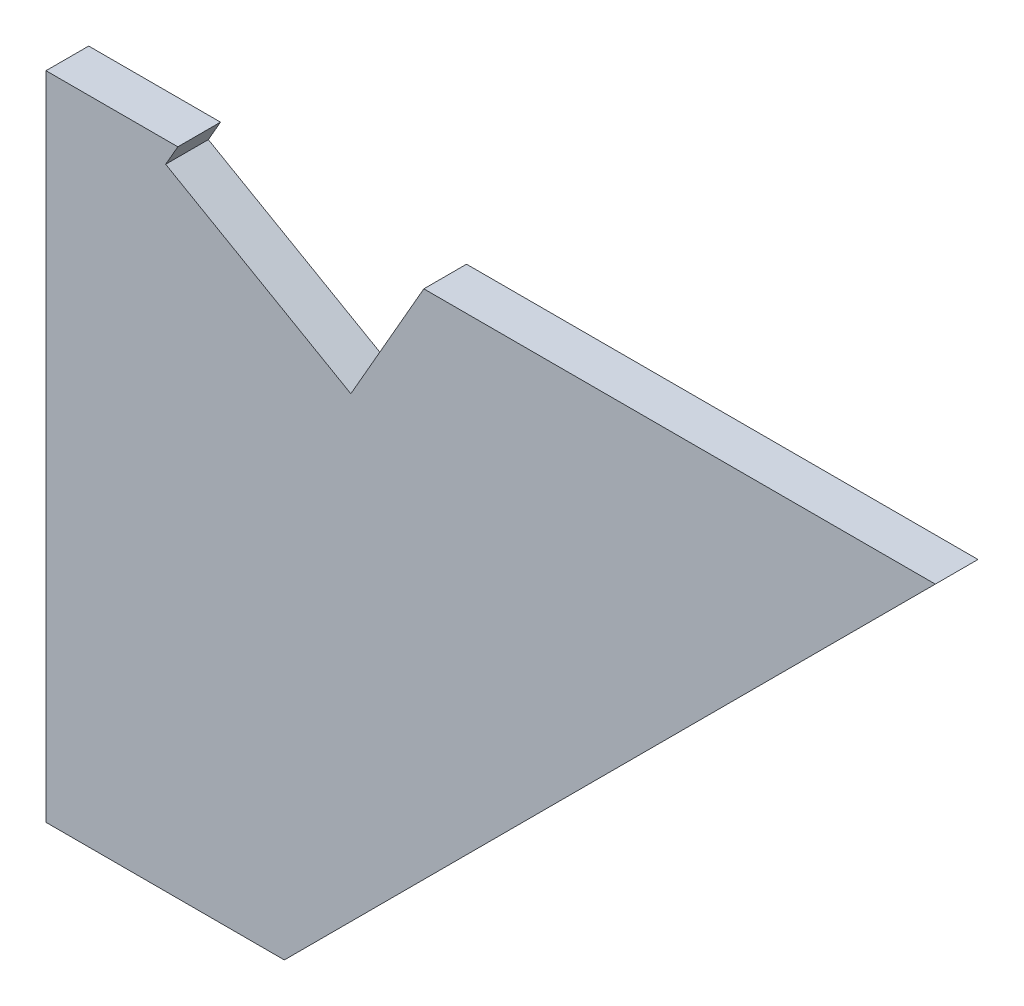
ISO-10303-21;
HEADER;
FILE_DESCRIPTION(('STEP AP214'),'2;1');
FILE_NAME('part.step','',(''),(''),'','','');
FILE_SCHEMA(('AUTOMOTIVE_DESIGN { 1 0 10303 214 1 1 1 1 }'));
ENDSEC;
DATA;
#1=APPLICATION_CONTEXT('core data for automotive mechanical design processes');
#2=APPLICATION_PROTOCOL_DEFINITION('international standard','automotive_design',2000,#1);
#3=PRODUCT_CONTEXT('',#1,'mechanical');
#4=PRODUCT('Part','Part','',(#3));
#5=PRODUCT_RELATED_PRODUCT_CATEGORY('part','',(#4));
#6=PRODUCT_DEFINITION_FORMATION('','',#4);
#7=PRODUCT_DEFINITION_CONTEXT('part definition',#1,'design');
#8=PRODUCT_DEFINITION('design','',#6,#7);
#9=PRODUCT_DEFINITION_SHAPE('','',#8);
#10=(LENGTH_UNIT() NAMED_UNIT(*) SI_UNIT(.MILLI.,.METRE.));
#11=(NAMED_UNIT(*) PLANE_ANGLE_UNIT() SI_UNIT($,.RADIAN.));
#12=(NAMED_UNIT(*) SI_UNIT($,.STERADIAN.) SOLID_ANGLE_UNIT());
#13=UNCERTAINTY_MEASURE_WITH_UNIT(LENGTH_MEASURE(1.E-05),#10,'distance_accuracy_value','');
#14=(GEOMETRIC_REPRESENTATION_CONTEXT(3) GLOBAL_UNCERTAINTY_ASSIGNED_CONTEXT((#13)) GLOBAL_UNIT_ASSIGNED_CONTEXT((#10,
#11,#12)) REPRESENTATION_CONTEXT('',''));
#15=CARTESIAN_POINT('',(0.,0.,0.));
#16=DIRECTION('',(0.,0.,1.));
#17=DIRECTION('',(1.,0.,0.));
#18=AXIS2_PLACEMENT_3D('',#15,#16,#17);
#19=CARTESIAN_POINT('',(250.,125.,0.));
#20=DIRECTION('',(0.707106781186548,-0.707106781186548,0.));
#21=DIRECTION('',(0.,0.,-1.));
#22=AXIS2_PLACEMENT_3D('',#19,#20,#21);
#23=PLANE('',#22);
#24=DIRECTION('',(-0.707106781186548,-0.707106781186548,0.));
#25=VECTOR('',#24,1.);
#26=CARTESIAN_POINT('',(250.,125.,0.));
#27=LINE('',#26,#25);
#28=CARTESIAN_POINT('',(250.,125.,0.));
#29=VERTEX_POINT('',#28);
#30=CARTESIAN_POINT('',(66.999999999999,-58.,0.));
#31=VERTEX_POINT('',#30);
#32=EDGE_CURVE('E139',#29,#31,#27,.T.);
#33=ORIENTED_EDGE('',*,*,#32,.F.);
#34=DIRECTION('',(0.,0.,1.));
#35=VECTOR('',#34,1.);
#36=CARTESIAN_POINT('',(250.,125.,0.));
#37=LINE('',#36,#35);
#38=CARTESIAN_POINT('',(250.,125.,12.));
#39=VERTEX_POINT('',#38);
#40=EDGE_CURVE('E36',#29,#39,#37,.T.);
#41=ORIENTED_EDGE('',*,*,#40,.T.);
#42=DIRECTION('',(-0.707106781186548,-0.707106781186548,0.));
#43=VECTOR('',#42,1.);
#44=CARTESIAN_POINT('',(250.,125.,12.));
#45=LINE('',#44,#43);
#46=CARTESIAN_POINT('',(66.999999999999,-58.,12.));
#47=VERTEX_POINT('',#46);
#48=EDGE_CURVE('E163',#39,#47,#45,.T.);
#49=ORIENTED_EDGE('',*,*,#48,.T.);
#50=DIRECTION('',(0.,0.,1.));
#51=VECTOR('',#50,1.);
#52=CARTESIAN_POINT('',(66.999999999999,-58.,0.));
#53=LINE('',#52,#51);
#54=EDGE_CURVE('E49',#31,#47,#53,.T.);
#55=ORIENTED_EDGE('',*,*,#54,.F.);
#56=EDGE_LOOP('',(#33,#41,#49,#55));
#57=FACE_BOUND('',#56,.T.);
#58=ADVANCED_FACE('F16',(#57),#23,.T.);
#59=CARTESIAN_POINT('',(33.638951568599,119.03142836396,-24.001));
#60=DIRECTION('',(0.867615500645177,-0.497235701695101,0.));
#61=DIRECTION('',(0.,0.,-1.));
#62=AXIS2_PLACEMENT_3D('',#59,#60,#61);
#63=PLANE('',#62);
#64=DIRECTION('',(0.,0.,1.));
#65=VECTOR('',#64,1.);
#66=CARTESIAN_POINT('',(33.638951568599,119.03142836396,-24.001));
#67=LINE('',#66,#65);
#68=CARTESIAN_POINT('',(33.638951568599,119.03142836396,0.));
#69=VERTEX_POINT('',#68);
#70=CARTESIAN_POINT('',(33.638951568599,119.03142836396,12.));
#71=VERTEX_POINT('',#70);
#72=EDGE_CURVE('E10',#69,#71,#67,.T.);
#73=ORIENTED_EDGE('',*,*,#72,.F.);
#74=DIRECTION('',(-0.497235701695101,-0.867615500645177,0.));
#75=VECTOR('',#74,1.);
#76=CARTESIAN_POINT('',(22.62883027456,99.820112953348,0.));
#77=LINE('',#76,#75);
#78=CARTESIAN_POINT('',(37.059576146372,125.,0.));
#79=VERTEX_POINT('',#78);
#80=EDGE_CURVE('E120',#79,#69,#77,.T.);
#81=ORIENTED_EDGE('',*,*,#80,.F.);
#82=DIRECTION('',(0.,0.,-1.));
#83=VECTOR('',#82,1.);
#84=CARTESIAN_POINT('',(37.059576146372,125.,-12.0005));
#85=LINE('',#84,#83);
#86=CARTESIAN_POINT('',(37.059576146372,125.,12.));
#87=VERTEX_POINT('',#86);
#88=EDGE_CURVE('E105',#87,#79,#85,.T.);
#89=ORIENTED_EDGE('',*,*,#88,.F.);
#90=DIRECTION('',(-0.497235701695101,-0.867615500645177,0.));
#91=VECTOR('',#90,1.);
#92=CARTESIAN_POINT('',(22.62883027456,99.820112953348,12.));
#93=LINE('',#92,#91);
#94=EDGE_CURVE('E149',#87,#71,#93,.T.);
#95=ORIENTED_EDGE('',*,*,#94,.T.);
#96=EDGE_LOOP('',(#73,#81,#89,#95));
#97=FACE_BOUND('',#96,.T.);
#98=ADVANCED_FACE('F121',(#97),#63,.T.);
#99=CARTESIAN_POINT('',(33.638951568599,119.03142836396,-24.001));
#100=DIRECTION('',(0.497235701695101,0.867615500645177,0.));
#101=DIRECTION('',(0.,0.,-1.));
#102=AXIS2_PLACEMENT_3D('',#99,#100,#101);
#103=PLANE('',#102);
#104=DIRECTION('',(0.,0.,1.));
#105=VECTOR('',#104,1.);
#106=CARTESIAN_POINT('',(85.6976168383,89.196291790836,-24.001));
#107=LINE('',#106,#105);
#108=CARTESIAN_POINT('',(85.6976168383,89.196291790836,0.));
#109=VERTEX_POINT('',#108);
#110=CARTESIAN_POINT('',(85.6976168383,89.196291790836,12.));
#111=VERTEX_POINT('',#110);
#112=EDGE_CURVE('E24',#109,#111,#107,.T.);
#113=ORIENTED_EDGE('',*,*,#112,.F.);
#114=DIRECTION('',(0.867615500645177,-0.497235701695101,0.));
#115=VECTOR('',#114,1.);
#116=CARTESIAN_POINT('',(72.023770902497,97.032855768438,0.));
#117=LINE('',#116,#115);
#118=EDGE_CURVE('E126',#69,#109,#117,.T.);
#119=ORIENTED_EDGE('',*,*,#118,.F.);
#120=ORIENTED_EDGE('',*,*,#72,.T.);
#121=DIRECTION('',(0.867615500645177,-0.497235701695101,0.));
#122=VECTOR('',#121,1.);
#123=CARTESIAN_POINT('',(72.023770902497,97.032855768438,12.));
#124=LINE('',#123,#122);
#125=EDGE_CURVE('E146',#71,#111,#124,.T.);
#126=ORIENTED_EDGE('',*,*,#125,.T.);
#127=EDGE_LOOP('',(#113,#119,#120,#126));
#128=FACE_BOUND('',#127,.T.);
#129=ADVANCED_FACE('F213',(#128),#103,.T.);
#130=CARTESIAN_POINT('',(85.6976168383,89.196291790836,-24.001));
#131=DIRECTION('',(0.867615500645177,-0.497235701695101,0.));
#132=DIRECTION('',(0.,0.,-1.));
#133=AXIS2_PLACEMENT_3D('',#130,#131,#132);
#134=PLANE('',#133);
#135=DIRECTION('',(-0.497235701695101,-0.867615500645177,0.));
#136=VECTOR('',#135,1.);
#137=CARTESIAN_POINT('',(74.687495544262,69.98497638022,12.));
#138=LINE('',#137,#136);
#139=CARTESIAN_POINT('',(106.21693900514,125.,12.));
#140=VERTEX_POINT('',#139);
#141=EDGE_CURVE('E117',#140,#111,#138,.T.);
#142=ORIENTED_EDGE('',*,*,#141,.F.);
#143=DIRECTION('',(0.,0.,-1.));
#144=VECTOR('',#143,1.);
#145=CARTESIAN_POINT('',(106.21693900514,125.,-12.0005));
#146=LINE('',#145,#144);
#147=CARTESIAN_POINT('',(106.21693900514,125.,0.));
#148=VERTEX_POINT('',#147);
#149=EDGE_CURVE('E65',#140,#148,#146,.T.);
#150=ORIENTED_EDGE('',*,*,#149,.T.);
#151=DIRECTION('',(-0.497235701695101,-0.867615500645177,0.));
#152=VECTOR('',#151,1.);
#153=CARTESIAN_POINT('',(74.687495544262,69.98497638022,0.));
#154=LINE('',#153,#152);
#155=EDGE_CURVE('E145',#148,#109,#154,.T.);
#156=ORIENTED_EDGE('',*,*,#155,.T.);
#157=ORIENTED_EDGE('',*,*,#112,.T.);
#158=EDGE_LOOP('',(#142,#150,#156,#157));
#159=FACE_BOUND('',#158,.T.);
#160=ADVANCED_FACE('F185',(#159),#134,.F.);
#161=CARTESIAN_POINT('',(0.,125.,0.));
#162=DIRECTION('',(0.,1.,0.));
#163=DIRECTION('',(1.,0.,0.));
#164=AXIS2_PLACEMENT_3D('',#161,#162,#163);
#165=PLANE('',#164);
#166=DIRECTION('',(1.,0.,0.));
#167=VECTOR('',#166,1.);
#168=CARTESIAN_POINT('',(0.,125.,0.));
#169=LINE('',#168,#167);
#170=EDGE_CURVE('E283',#148,#29,#169,.T.);
#171=ORIENTED_EDGE('',*,*,#170,.F.);
#172=ORIENTED_EDGE('',*,*,#149,.F.);
#173=DIRECTION('',(1.,0.,0.));
#174=VECTOR('',#173,1.);
#175=CARTESIAN_POINT('',(0.,125.,12.));
#176=LINE('',#175,#174);
#177=EDGE_CURVE('E166',#140,#39,#176,.T.);
#178=ORIENTED_EDGE('',*,*,#177,.T.);
#179=ORIENTED_EDGE('',*,*,#40,.F.);
#180=EDGE_LOOP('',(#171,#172,#178,#179));
#181=FACE_BOUND('',#180,.T.);
#182=ADVANCED_FACE('F179',(#181),#165,.T.);
#183=CARTESIAN_POINT('',(0.,-58.,0.));
#184=DIRECTION('',(0.,1.,0.));
#185=DIRECTION('',(1.,0.,0.));
#186=AXIS2_PLACEMENT_3D('',#183,#184,#185);
#187=PLANE('',#186);
#188=DIRECTION('',(1.,0.,0.));
#189=VECTOR('',#188,1.);
#190=CARTESIAN_POINT('',(44.194173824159,-58.,0.));
#191=LINE('',#190,#189);
#192=CARTESIAN_POINT('',(0.,-58.,0.));
#193=VERTEX_POINT('',#192);
#194=EDGE_CURVE('E135',#193,#31,#191,.T.);
#195=ORIENTED_EDGE('',*,*,#194,.T.);
#196=ORIENTED_EDGE('',*,*,#54,.T.);
#197=DIRECTION('',(1.,0.,0.));
#198=VECTOR('',#197,1.);
#199=CARTESIAN_POINT('',(44.194173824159,-58.,12.));
#200=LINE('',#199,#198);
#201=CARTESIAN_POINT('',(0.,-58.,12.));
#202=VERTEX_POINT('',#201);
#203=EDGE_CURVE('E159',#202,#47,#200,.T.);
#204=ORIENTED_EDGE('',*,*,#203,.F.);
#205=DIRECTION('',(0.,0.,-1.));
#206=VECTOR('',#205,1.);
#207=CARTESIAN_POINT('',(0.,-58.,0.));
#208=LINE('',#207,#206);
#209=EDGE_CURVE('E266',#202,#193,#208,.T.);
#210=ORIENTED_EDGE('',*,*,#209,.T.);
#211=EDGE_LOOP('',(#195,#196,#204,#210));
#212=FACE_BOUND('',#211,.T.);
#213=ADVANCED_FACE('F184',(#212),#187,.F.);
#214=CARTESIAN_POINT('',(88.388347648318,36.611652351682,12.));
#215=DIRECTION('',(0.,0.,-1.));
#216=DIRECTION('',(0.,-1.,0.));
#217=AXIS2_PLACEMENT_3D('',#214,#215,#216);
#218=PLANE('',#217);
#219=ORIENTED_EDGE('',*,*,#141,.T.);
#220=ORIENTED_EDGE('',*,*,#125,.F.);
#221=ORIENTED_EDGE('',*,*,#94,.F.);
#222=DIRECTION('',(1.,0.,0.));
#223=VECTOR('',#222,1.);
#224=CARTESIAN_POINT('',(0.,125.,12.));
#225=LINE('',#224,#223);
#226=CARTESIAN_POINT('',(0.,125.,12.));
#227=VERTEX_POINT('',#226);
#228=EDGE_CURVE('E113',#227,#87,#225,.T.);
#229=ORIENTED_EDGE('',*,*,#228,.F.);
#230=DIRECTION('',(0.,1.,0.));
#231=VECTOR('',#230,1.);
#232=CARTESIAN_POINT('',(0.,-125.,12.));
#233=LINE('',#232,#231);
#234=EDGE_CURVE('E269',#202,#227,#233,.T.);
#235=ORIENTED_EDGE('',*,*,#234,.F.);
#236=ORIENTED_EDGE('',*,*,#203,.T.);
#237=ORIENTED_EDGE('',*,*,#48,.F.);
#238=ORIENTED_EDGE('',*,*,#177,.F.);
#239=EDGE_LOOP('',(#219,#220,#221,#229,#235,#236,#237,#238));
#240=FACE_BOUND('',#239,.T.);
#241=ADVANCED_FACE('F222',(#240),#218,.F.);
#242=CARTESIAN_POINT('',(0.,125.,0.));
#243=DIRECTION('',(0.,1.,0.));
#244=DIRECTION('',(1.,0.,0.));
#245=AXIS2_PLACEMENT_3D('',#242,#243,#244);
#246=PLANE('',#245);
#247=DIRECTION('',(1.,0.,0.));
#248=VECTOR('',#247,1.);
#249=CARTESIAN_POINT('',(0.,125.,0.));
#250=LINE('',#249,#248);
#251=CARTESIAN_POINT('',(0.,125.,0.));
#252=VERTEX_POINT('',#251);
#253=EDGE_CURVE('E111',#252,#79,#250,.T.);
#254=ORIENTED_EDGE('',*,*,#253,.F.);
#255=DIRECTION('',(0.,0.,1.));
#256=VECTOR('',#255,1.);
#257=CARTESIAN_POINT('',(0.,125.,0.));
#258=LINE('',#257,#256);
#259=EDGE_CURVE('E271',#252,#227,#258,.T.);
#260=ORIENTED_EDGE('',*,*,#259,.T.);
#261=ORIENTED_EDGE('',*,*,#228,.T.);
#262=ORIENTED_EDGE('',*,*,#88,.T.);
#263=EDGE_LOOP('',(#254,#260,#261,#262));
#264=FACE_BOUND('',#263,.T.);
#265=ADVANCED_FACE('F107',(#264),#246,.T.);
#266=CARTESIAN_POINT('',(88.388347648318,36.611652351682,0.));
#267=DIRECTION('',(0.,0.,-1.));
#268=DIRECTION('',(0.,-1.,0.));
#269=AXIS2_PLACEMENT_3D('',#266,#267,#268);
#270=PLANE('',#269);
#271=ORIENTED_EDGE('',*,*,#170,.T.);
#272=ORIENTED_EDGE('',*,*,#32,.T.);
#273=ORIENTED_EDGE('',*,*,#194,.F.);
#274=DIRECTION('',(0.,1.,0.));
#275=VECTOR('',#274,1.);
#276=CARTESIAN_POINT('',(0.,-125.,0.));
#277=LINE('',#276,#275);
#278=EDGE_CURVE('E133',#193,#252,#277,.T.);
#279=ORIENTED_EDGE('',*,*,#278,.T.);
#280=ORIENTED_EDGE('',*,*,#253,.T.);
#281=ORIENTED_EDGE('',*,*,#80,.T.);
#282=ORIENTED_EDGE('',*,*,#118,.T.);
#283=ORIENTED_EDGE('',*,*,#155,.F.);
#284=EDGE_LOOP('',(#271,#272,#273,#279,#280,#281,#282,#283));
#285=FACE_BOUND('',#284,.T.);
#286=ADVANCED_FACE('F130',(#285),#270,.T.);
#287=CARTESIAN_POINT('',(0.,-125.,0.));
#288=DIRECTION('',(-1.,0.,0.));
#289=DIRECTION('',(0.,0.,1.));
#290=AXIS2_PLACEMENT_3D('',#287,#288,#289);
#291=PLANE('',#290);
#292=ORIENTED_EDGE('',*,*,#278,.F.);
#293=ORIENTED_EDGE('',*,*,#209,.F.);
#294=ORIENTED_EDGE('',*,*,#234,.T.);
#295=ORIENTED_EDGE('',*,*,#259,.F.);
#296=EDGE_LOOP('',(#292,#293,#294,#295));
#297=FACE_BOUND('',#296,.T.);
#298=ADVANCED_FACE('F192',(#297),#291,.T.);
#299=CLOSED_SHELL('',(#58,#98,#129,#160,#182,#213,#241,#265,#286,#298));
#300=MANIFOLD_SOLID_BREP('B1',#299);
#301=ADVANCED_BREP_SHAPE_REPRESENTATION('',(#18,#300),#14);
#302=SHAPE_DEFINITION_REPRESENTATION(#9,#301);
ENDSEC;
END-ISO-10303-21;
